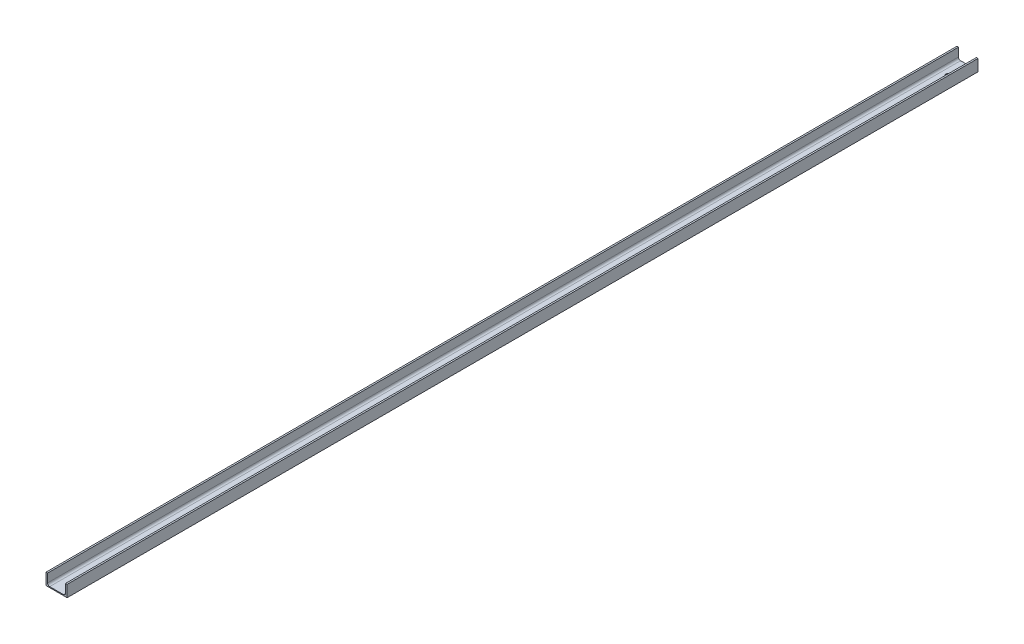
ISO-10303-21;
HEADER;
FILE_DESCRIPTION(('STEP AP214'),'2;1');
FILE_NAME('part.step','',(''),(''),'','','');
FILE_SCHEMA(('AUTOMOTIVE_DESIGN { 1 0 10303 214 1 1 1 1 }'));
ENDSEC;
DATA;
#1=APPLICATION_CONTEXT('core data for automotive mechanical design processes');
#2=APPLICATION_PROTOCOL_DEFINITION('international standard','automotive_design',2000,#1);
#3=PRODUCT_CONTEXT('',#1,'mechanical');
#4=PRODUCT('Part','Part','',(#3));
#5=PRODUCT_RELATED_PRODUCT_CATEGORY('part','',(#4));
#6=PRODUCT_DEFINITION_FORMATION('','',#4);
#7=PRODUCT_DEFINITION_CONTEXT('part definition',#1,'design');
#8=PRODUCT_DEFINITION('design','',#6,#7);
#9=PRODUCT_DEFINITION_SHAPE('','',#8);
#10=(LENGTH_UNIT() NAMED_UNIT(*) SI_UNIT(.MILLI.,.METRE.));
#11=(NAMED_UNIT(*) PLANE_ANGLE_UNIT() SI_UNIT($,.RADIAN.));
#12=(NAMED_UNIT(*) SI_UNIT($,.STERADIAN.) SOLID_ANGLE_UNIT());
#13=UNCERTAINTY_MEASURE_WITH_UNIT(LENGTH_MEASURE(1.E-05),#10,'distance_accuracy_value','');
#14=(GEOMETRIC_REPRESENTATION_CONTEXT(3) GLOBAL_UNCERTAINTY_ASSIGNED_CONTEXT((#13)) GLOBAL_UNIT_ASSIGNED_CONTEXT((#10,
#11,#12)) REPRESENTATION_CONTEXT('',''));
#15=CARTESIAN_POINT('',(0.,0.,0.));
#16=DIRECTION('',(0.,0.,1.));
#17=DIRECTION('',(1.,0.,0.));
#18=AXIS2_PLACEMENT_3D('',#15,#16,#17);
#19=CARTESIAN_POINT('',(0.,0.,4317.));
#20=DIRECTION('',(0.,1.,0.));
#21=DIRECTION('',(0.,0.,1.));
#22=AXIS2_PLACEMENT_3D('',#19,#20,#21);
#23=PLANE('',#22);
#24=CARTESIAN_POINT('',(50.000000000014,0.,4202.));
#25=DIRECTION('',(0.,1.,0.));
#26=DIRECTION('',(-1.,0.,0.));
#27=AXIS2_PLACEMENT_3D('',#24,#25,#26);
#28=CIRCLE('',#27,7.50000000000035);
#29=CARTESIAN_POINT('',(42.5000000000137,0.,4202.));
#30=VERTEX_POINT('',#29);
#31=EDGE_CURVE('E236',#30,#30,#28,.T.);
#32=ORIENTED_EDGE('',*,*,#31,.T.);
#33=EDGE_LOOP('',(#32));
#34=FACE_BOUND('',#33,.T.);
#35=CARTESIAN_POINT('',(50.0000000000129,0.,3893.));
#36=DIRECTION('',(0.,1.,0.));
#37=DIRECTION('',(-1.,0.,0.));
#38=AXIS2_PLACEMENT_3D('',#35,#36,#37);
#39=CIRCLE('',#38,7.4999999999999);
#40=CARTESIAN_POINT('',(42.500000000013,0.,3893.));
#41=VERTEX_POINT('',#40);
#42=EDGE_CURVE('E240',#41,#41,#39,.T.);
#43=ORIENTED_EDGE('',*,*,#42,.T.);
#44=EDGE_LOOP('',(#43));
#45=FACE_BOUND('',#44,.T.);
#46=CARTESIAN_POINT('',(50.0000000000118,0.,3584.));
#47=DIRECTION('',(0.,1.,0.));
#48=DIRECTION('',(-1.,0.,0.));
#49=AXIS2_PLACEMENT_3D('',#46,#47,#48);
#50=CIRCLE('',#49,7.4999999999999);
#51=CARTESIAN_POINT('',(42.5000000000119,0.,3584.));
#52=VERTEX_POINT('',#51);
#53=EDGE_CURVE('E244',#52,#52,#50,.T.);
#54=ORIENTED_EDGE('',*,*,#53,.T.);
#55=EDGE_LOOP('',(#54));
#56=FACE_BOUND('',#55,.T.);
#57=CARTESIAN_POINT('',(50.0000000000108,0.,3275.));
#58=DIRECTION('',(0.,1.,0.));
#59=DIRECTION('',(-1.,0.,0.));
#60=AXIS2_PLACEMENT_3D('',#57,#58,#59);
#61=CIRCLE('',#60,7.4999999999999);
#62=CARTESIAN_POINT('',(42.5000000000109,0.,3275.));
#63=VERTEX_POINT('',#62);
#64=EDGE_CURVE('E248',#63,#63,#61,.T.);
#65=ORIENTED_EDGE('',*,*,#64,.T.);
#66=EDGE_LOOP('',(#65));
#67=FACE_BOUND('',#66,.T.);
#68=CARTESIAN_POINT('',(50.0000000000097,0.,2966.));
#69=DIRECTION('',(0.,1.,0.));
#70=DIRECTION('',(-1.,0.,0.));
#71=AXIS2_PLACEMENT_3D('',#68,#69,#70);
#72=CIRCLE('',#71,7.4999999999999);
#73=CARTESIAN_POINT('',(42.5000000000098,0.,2966.));
#74=VERTEX_POINT('',#73);
#75=EDGE_CURVE('E252',#74,#74,#72,.T.);
#76=ORIENTED_EDGE('',*,*,#75,.T.);
#77=EDGE_LOOP('',(#76));
#78=FACE_BOUND('',#77,.T.);
#79=CARTESIAN_POINT('',(50.0000000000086,0.,2657.));
#80=DIRECTION('',(0.,1.,0.));
#81=DIRECTION('',(-1.,0.,0.));
#82=AXIS2_PLACEMENT_3D('',#79,#80,#81);
#83=CIRCLE('',#82,7.4999999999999);
#84=CARTESIAN_POINT('',(42.5000000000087,0.,2657.));
#85=VERTEX_POINT('',#84);
#86=EDGE_CURVE('E256',#85,#85,#83,.T.);
#87=ORIENTED_EDGE('',*,*,#86,.T.);
#88=EDGE_LOOP('',(#87));
#89=FACE_BOUND('',#88,.T.);
#90=CARTESIAN_POINT('',(50.0000000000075,0.,2348.));
#91=DIRECTION('',(0.,1.,0.));
#92=DIRECTION('',(-1.,0.,0.));
#93=AXIS2_PLACEMENT_3D('',#90,#91,#92);
#94=CIRCLE('',#93,7.4999999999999);
#95=CARTESIAN_POINT('',(42.5000000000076,0.,2348.));
#96=VERTEX_POINT('',#95);
#97=EDGE_CURVE('E260',#96,#96,#94,.T.);
#98=ORIENTED_EDGE('',*,*,#97,.T.);
#99=EDGE_LOOP('',(#98));
#100=FACE_BOUND('',#99,.T.);
#101=CARTESIAN_POINT('',(50.0000000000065,0.,2039.));
#102=DIRECTION('',(0.,1.,0.));
#103=DIRECTION('',(-1.,0.,0.));
#104=AXIS2_PLACEMENT_3D('',#101,#102,#103);
#105=CIRCLE('',#104,7.4999999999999);
#106=CARTESIAN_POINT('',(42.5000000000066,0.,2039.));
#107=VERTEX_POINT('',#106);
#108=EDGE_CURVE('E264',#107,#107,#105,.T.);
#109=ORIENTED_EDGE('',*,*,#108,.T.);
#110=EDGE_LOOP('',(#109));
#111=FACE_BOUND('',#110,.T.);
#112=CARTESIAN_POINT('',(50.0000000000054,0.,1730.));
#113=DIRECTION('',(0.,1.,0.));
#114=DIRECTION('',(-1.,0.,0.));
#115=AXIS2_PLACEMENT_3D('',#112,#113,#114);
#116=CIRCLE('',#115,7.4999999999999);
#117=CARTESIAN_POINT('',(42.5000000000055,0.,1730.));
#118=VERTEX_POINT('',#117);
#119=EDGE_CURVE('E268',#118,#118,#116,.T.);
#120=ORIENTED_EDGE('',*,*,#119,.T.);
#121=EDGE_LOOP('',(#120));
#122=FACE_BOUND('',#121,.T.);
#123=CARTESIAN_POINT('',(50.0000000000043,0.,1421.));
#124=DIRECTION('',(0.,1.,0.));
#125=DIRECTION('',(-1.,0.,0.));
#126=AXIS2_PLACEMENT_3D('',#123,#124,#125);
#127=CIRCLE('',#126,7.50000000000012);
#128=CARTESIAN_POINT('',(42.5000000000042,0.,1421.));
#129=VERTEX_POINT('',#128);
#130=EDGE_CURVE('E272',#129,#129,#127,.T.);
#131=ORIENTED_EDGE('',*,*,#130,.T.);
#132=EDGE_LOOP('',(#131));
#133=FACE_BOUND('',#132,.T.);
#134=CARTESIAN_POINT('',(50.0000000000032,0.,1112.));
#135=DIRECTION('',(0.,1.,0.));
#136=DIRECTION('',(-1.,0.,0.));
#137=AXIS2_PLACEMENT_3D('',#134,#135,#136);
#138=CIRCLE('',#137,7.4999999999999);
#139=CARTESIAN_POINT('',(42.5000000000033,0.,1112.));
#140=VERTEX_POINT('',#139);
#141=EDGE_CURVE('E276',#140,#140,#138,.T.);
#142=ORIENTED_EDGE('',*,*,#141,.T.);
#143=EDGE_LOOP('',(#142));
#144=FACE_BOUND('',#143,.T.);
#145=CARTESIAN_POINT('',(50.0000000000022,0.,803.));
#146=DIRECTION('',(0.,1.,0.));
#147=DIRECTION('',(-1.,0.,0.));
#148=AXIS2_PLACEMENT_3D('',#145,#146,#147);
#149=CIRCLE('',#148,7.50000000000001);
#150=CARTESIAN_POINT('',(42.5000000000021,0.,803.));
#151=VERTEX_POINT('',#150);
#152=EDGE_CURVE('E280',#151,#151,#149,.T.);
#153=ORIENTED_EDGE('',*,*,#152,.T.);
#154=EDGE_LOOP('',(#153));
#155=FACE_BOUND('',#154,.T.);
#156=CARTESIAN_POINT('',(50.0000000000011,0.,494.));
#157=DIRECTION('',(0.,1.,0.));
#158=DIRECTION('',(-1.,0.,0.));
#159=AXIS2_PLACEMENT_3D('',#156,#157,#158);
#160=CIRCLE('',#159,7.50000000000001);
#161=CARTESIAN_POINT('',(42.5000000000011,0.,494.));
#162=VERTEX_POINT('',#161);
#163=EDGE_CURVE('E284',#162,#162,#160,.T.);
#164=ORIENTED_EDGE('',*,*,#163,.T.);
#165=EDGE_LOOP('',(#164));
#166=FACE_BOUND('',#165,.T.);
#167=CARTESIAN_POINT('',(50.,0.,90.));
#168=DIRECTION('',(0.,1.,0.));
#169=DIRECTION('',(-1.,0.,0.));
#170=AXIS2_PLACEMENT_3D('',#167,#168,#169);
#171=CIRCLE('',#170,12.5);
#172=CARTESIAN_POINT('',(37.5,0.,90.));
#173=VERTEX_POINT('',#172);
#174=EDGE_CURVE('E288',#173,#173,#171,.T.);
#175=ORIENTED_EDGE('',*,*,#174,.T.);
#176=EDGE_LOOP('',(#175));
#177=FACE_BOUND('',#176,.T.);
#178=CARTESIAN_POINT('',(50.,0.,185.));
#179=DIRECTION('',(0.,1.,0.));
#180=DIRECTION('',(-1.,0.,0.));
#181=AXIS2_PLACEMENT_3D('',#178,#179,#180);
#182=CIRCLE('',#181,7.50000000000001);
#183=CARTESIAN_POINT('',(42.5,0.,185.));
#184=VERTEX_POINT('',#183);
#185=EDGE_CURVE('E126',#184,#184,#182,.T.);
#186=ORIENTED_EDGE('',*,*,#185,.T.);
#187=EDGE_LOOP('',(#186));
#188=FACE_BOUND('',#187,.T.);
#189=DIRECTION('',(1.,0.,0.));
#190=VECTOR('',#189,1.);
#191=CARTESIAN_POINT('',(0.,0.,0.));
#192=LINE('',#191,#190);
#193=CARTESIAN_POINT('',(0.,0.,0.));
#194=VERTEX_POINT('',#193);
#195=CARTESIAN_POINT('',(100.,0.,0.));
#196=VERTEX_POINT('',#195);
#197=EDGE_CURVE('E114',#194,#196,#192,.T.);
#198=ORIENTED_EDGE('',*,*,#197,.T.);
#199=DIRECTION('',(0.,0.,-1.));
#200=VECTOR('',#199,1.);
#201=CARTESIAN_POINT('',(100.,0.,4317.));
#202=LINE('',#201,#200);
#203=CARTESIAN_POINT('',(100.,0.,4317.));
#204=VERTEX_POINT('',#203);
#205=EDGE_CURVE('E11',#204,#196,#202,.T.);
#206=ORIENTED_EDGE('',*,*,#205,.F.);
#207=DIRECTION('',(1.,0.,0.));
#208=VECTOR('',#207,1.);
#209=CARTESIAN_POINT('',(0.,0.,4317.));
#210=LINE('',#209,#208);
#211=CARTESIAN_POINT('',(0.,0.,4317.));
#212=VERTEX_POINT('',#211);
#213=EDGE_CURVE('E150',#212,#204,#210,.T.);
#214=ORIENTED_EDGE('',*,*,#213,.F.);
#215=DIRECTION('',(0.,0.,-1.));
#216=VECTOR('',#215,1.);
#217=CARTESIAN_POINT('',(0.,0.,4317.));
#218=LINE('',#217,#216);
#219=EDGE_CURVE('E46',#212,#194,#218,.T.);
#220=ORIENTED_EDGE('',*,*,#219,.T.);
#221=EDGE_LOOP('',(#198,#206,#214,#220));
#222=FACE_BOUND('',#221,.T.);
#223=ADVANCED_FACE('F32',(#34,#45,#56,#67,#78,#89,#100,#111,#122,#133,#144,#155,#166,#177,#188,
#222),#23,.F.);
#224=CARTESIAN_POINT('',(100.,0.,4317.));
#225=DIRECTION('',(-1.,0.,0.));
#226=DIRECTION('',(0.,0.,1.));
#227=AXIS2_PLACEMENT_3D('',#224,#225,#226);
#228=PLANE('',#227);
#229=DIRECTION('',(0.,1.,0.));
#230=VECTOR('',#229,1.);
#231=CARTESIAN_POINT('',(100.,0.,0.));
#232=LINE('',#231,#230);
#233=CARTESIAN_POINT('',(100.,55.,0.));
#234=VERTEX_POINT('',#233);
#235=EDGE_CURVE('E110',#196,#234,#232,.T.);
#236=ORIENTED_EDGE('',*,*,#235,.T.);
#237=DIRECTION('',(0.,0.,-1.));
#238=VECTOR('',#237,1.);
#239=CARTESIAN_POINT('',(100.,55.,4317.));
#240=LINE('',#239,#238);
#241=CARTESIAN_POINT('',(100.,55.,4317.));
#242=VERTEX_POINT('',#241);
#243=EDGE_CURVE('E39',#242,#234,#240,.T.);
#244=ORIENTED_EDGE('',*,*,#243,.F.);
#245=DIRECTION('',(0.,1.,0.));
#246=VECTOR('',#245,1.);
#247=CARTESIAN_POINT('',(100.,0.,4317.));
#248=LINE('',#247,#246);
#249=EDGE_CURVE('E123',#204,#242,#248,.T.);
#250=ORIENTED_EDGE('',*,*,#249,.F.);
#251=ORIENTED_EDGE('',*,*,#205,.T.);
#252=EDGE_LOOP('',(#236,#244,#250,#251));
#253=FACE_BOUND('',#252,.T.);
#254=ADVANCED_FACE('F122',(#253),#228,.F.);
#255=CARTESIAN_POINT('',(100.,55.,4317.));
#256=DIRECTION('',(0.,-1.,0.));
#257=DIRECTION('',(0.,0.,-1.));
#258=AXIS2_PLACEMENT_3D('',#255,#256,#257);
#259=PLANE('',#258);
#260=DIRECTION('',(-1.,0.,0.));
#261=VECTOR('',#260,1.);
#262=CARTESIAN_POINT('',(100.,55.,0.));
#263=LINE('',#262,#261);
#264=CARTESIAN_POINT('',(92.5,55.,0.));
#265=VERTEX_POINT('',#264);
#266=EDGE_CURVE('E116',#234,#265,#263,.T.);
#267=ORIENTED_EDGE('',*,*,#266,.T.);
#268=DIRECTION('',(0.,0.,-1.));
#269=VECTOR('',#268,1.);
#270=CARTESIAN_POINT('',(92.5,55.,4317.));
#271=LINE('',#270,#269);
#272=CARTESIAN_POINT('',(92.5,55.,4317.));
#273=VERTEX_POINT('',#272);
#274=EDGE_CURVE('E185',#273,#265,#271,.T.);
#275=ORIENTED_EDGE('',*,*,#274,.F.);
#276=DIRECTION('',(-1.,0.,0.));
#277=VECTOR('',#276,1.);
#278=CARTESIAN_POINT('',(100.,55.,4317.));
#279=LINE('',#278,#277);
#280=EDGE_CURVE('E153',#242,#273,#279,.T.);
#281=ORIENTED_EDGE('',*,*,#280,.F.);
#282=ORIENTED_EDGE('',*,*,#243,.T.);
#283=EDGE_LOOP('',(#267,#275,#281,#282));
#284=FACE_BOUND('',#283,.T.);
#285=ADVANCED_FACE('F189',(#284),#259,.F.);
#286=CARTESIAN_POINT('',(92.5,55.,4317.));
#287=DIRECTION('',(1.,0.,0.));
#288=DIRECTION('',(0.,0.,-1.));
#289=AXIS2_PLACEMENT_3D('',#286,#287,#288);
#290=PLANE('',#289);
#291=DIRECTION('',(0.,-1.,0.));
#292=VECTOR('',#291,1.);
#293=CARTESIAN_POINT('',(92.5,55.,0.));
#294=LINE('',#293,#292);
#295=CARTESIAN_POINT('',(92.5,14.5000000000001,0.));
#296=VERTEX_POINT('',#295);
#297=EDGE_CURVE('E134',#265,#296,#294,.T.);
#298=ORIENTED_EDGE('',*,*,#297,.T.);
#299=DIRECTION('',(0.,0.,-1.));
#300=VECTOR('',#299,1.);
#301=CARTESIAN_POINT('',(92.5,14.5000000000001,4317.));
#302=LINE('',#301,#300);
#303=CARTESIAN_POINT('',(92.5,14.5000000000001,4317.));
#304=VERTEX_POINT('',#303);
#305=EDGE_CURVE('E182',#304,#296,#302,.T.);
#306=ORIENTED_EDGE('',*,*,#305,.F.);
#307=DIRECTION('',(0.,-1.,0.));
#308=VECTOR('',#307,1.);
#309=CARTESIAN_POINT('',(92.5,55.,4317.));
#310=LINE('',#309,#308);
#311=EDGE_CURVE('E155',#273,#304,#310,.T.);
#312=ORIENTED_EDGE('',*,*,#311,.F.);
#313=ORIENTED_EDGE('',*,*,#274,.T.);
#314=EDGE_LOOP('',(#298,#306,#312,#313));
#315=FACE_BOUND('',#314,.T.);
#316=ADVANCED_FACE('F219',(#315),#290,.F.);
#317=CARTESIAN_POINT('',(82.5,14.5,4317.));
#318=DIRECTION('',(0.,0.,-1.));
#319=DIRECTION('',(-1.,0.,0.));
#320=AXIS2_PLACEMENT_3D('',#317,#318,#319);
#321=CYLINDRICAL_SURFACE('',#320,10.);
#322=CARTESIAN_POINT('',(82.5,14.5,0.));
#323=DIRECTION('',(0.,0.,-1.));
#324=DIRECTION('',(-1.,0.,0.));
#325=AXIS2_PLACEMENT_3D('',#322,#323,#324);
#326=CIRCLE('',#325,10.);
#327=CARTESIAN_POINT('',(82.4999999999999,4.5,0.));
#328=VERTEX_POINT('',#327);
#329=EDGE_CURVE('E136',#296,#328,#326,.T.);
#330=ORIENTED_EDGE('',*,*,#329,.T.);
#331=DIRECTION('',(0.,0.,-1.));
#332=VECTOR('',#331,1.);
#333=CARTESIAN_POINT('',(82.4999999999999,4.5,4317.));
#334=LINE('',#333,#332);
#335=CARTESIAN_POINT('',(82.4999999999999,4.5,4317.));
#336=VERTEX_POINT('',#335);
#337=EDGE_CURVE('E179',#336,#328,#334,.T.);
#338=ORIENTED_EDGE('',*,*,#337,.F.);
#339=CARTESIAN_POINT('',(82.5,14.5,4317.));
#340=DIRECTION('',(0.,0.,-1.));
#341=DIRECTION('',(-1.,0.,0.));
#342=AXIS2_PLACEMENT_3D('',#339,#340,#341);
#343=CIRCLE('',#342,10.);
#344=EDGE_CURVE('E157',#304,#336,#343,.T.);
#345=ORIENTED_EDGE('',*,*,#344,.F.);
#346=ORIENTED_EDGE('',*,*,#305,.T.);
#347=EDGE_LOOP('',(#330,#338,#345,#346));
#348=FACE_BOUND('',#347,.T.);
#349=ADVANCED_FACE('F216',(#348),#321,.F.);
#350=CARTESIAN_POINT('',(82.4999999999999,4.5,4317.));
#351=DIRECTION('',(0.,-1.,0.));
#352=DIRECTION('',(1.,0.,0.));
#353=AXIS2_PLACEMENT_3D('',#350,#351,#352);
#354=PLANE('',#353);
#355=CARTESIAN_POINT('',(50.000000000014,4.49999999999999,4202.));
#356=DIRECTION('',(0.,1.,0.));
#357=DIRECTION('',(-1.,0.,0.));
#358=AXIS2_PLACEMENT_3D('',#355,#356,#357);
#359=CIRCLE('',#358,7.50000000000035);
#360=CARTESIAN_POINT('',(42.5000000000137,4.49999999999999,4202.));
#361=VERTEX_POINT('',#360);
#362=EDGE_CURVE('E353',#361,#361,#359,.T.);
#363=ORIENTED_EDGE('',*,*,#362,.F.);
#364=EDGE_LOOP('',(#363));
#365=FACE_BOUND('',#364,.T.);
#366=CARTESIAN_POINT('',(50.0000000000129,4.49999999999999,3893.));
#367=DIRECTION('',(0.,1.,0.));
#368=DIRECTION('',(-1.,0.,0.));
#369=AXIS2_PLACEMENT_3D('',#366,#367,#368);
#370=CIRCLE('',#369,7.4999999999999);
#371=CARTESIAN_POINT('',(42.500000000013,4.49999999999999,3893.));
#372=VERTEX_POINT('',#371);
#373=EDGE_CURVE('E349',#372,#372,#370,.T.);
#374=ORIENTED_EDGE('',*,*,#373,.F.);
#375=EDGE_LOOP('',(#374));
#376=FACE_BOUND('',#375,.T.);
#377=CARTESIAN_POINT('',(50.0000000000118,4.49999999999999,3584.));
#378=DIRECTION('',(0.,1.,0.));
#379=DIRECTION('',(-1.,0.,0.));
#380=AXIS2_PLACEMENT_3D('',#377,#378,#379);
#381=CIRCLE('',#380,7.4999999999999);
#382=CARTESIAN_POINT('',(42.5000000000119,4.49999999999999,3584.));
#383=VERTEX_POINT('',#382);
#384=EDGE_CURVE('E345',#383,#383,#381,.T.);
#385=ORIENTED_EDGE('',*,*,#384,.F.);
#386=EDGE_LOOP('',(#385));
#387=FACE_BOUND('',#386,.T.);
#388=CARTESIAN_POINT('',(50.0000000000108,4.49999999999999,3275.));
#389=DIRECTION('',(0.,1.,0.));
#390=DIRECTION('',(-1.,0.,0.));
#391=AXIS2_PLACEMENT_3D('',#388,#389,#390);
#392=CIRCLE('',#391,7.4999999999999);
#393=CARTESIAN_POINT('',(42.5000000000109,4.49999999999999,3275.));
#394=VERTEX_POINT('',#393);
#395=EDGE_CURVE('E341',#394,#394,#392,.T.);
#396=ORIENTED_EDGE('',*,*,#395,.F.);
#397=EDGE_LOOP('',(#396));
#398=FACE_BOUND('',#397,.T.);
#399=CARTESIAN_POINT('',(50.0000000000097,4.49999999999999,2966.));
#400=DIRECTION('',(0.,1.,0.));
#401=DIRECTION('',(-1.,0.,0.));
#402=AXIS2_PLACEMENT_3D('',#399,#400,#401);
#403=CIRCLE('',#402,7.4999999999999);
#404=CARTESIAN_POINT('',(42.5000000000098,4.49999999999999,2966.));
#405=VERTEX_POINT('',#404);
#406=EDGE_CURVE('E337',#405,#405,#403,.T.);
#407=ORIENTED_EDGE('',*,*,#406,.F.);
#408=EDGE_LOOP('',(#407));
#409=FACE_BOUND('',#408,.T.);
#410=CARTESIAN_POINT('',(50.0000000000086,4.49999999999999,2657.));
#411=DIRECTION('',(0.,1.,0.));
#412=DIRECTION('',(-1.,0.,0.));
#413=AXIS2_PLACEMENT_3D('',#410,#411,#412);
#414=CIRCLE('',#413,7.4999999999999);
#415=CARTESIAN_POINT('',(42.5000000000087,4.49999999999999,2657.));
#416=VERTEX_POINT('',#415);
#417=EDGE_CURVE('E333',#416,#416,#414,.T.);
#418=ORIENTED_EDGE('',*,*,#417,.F.);
#419=EDGE_LOOP('',(#418));
#420=FACE_BOUND('',#419,.T.);
#421=CARTESIAN_POINT('',(50.0000000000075,4.49999999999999,2348.));
#422=DIRECTION('',(0.,1.,0.));
#423=DIRECTION('',(-1.,0.,0.));
#424=AXIS2_PLACEMENT_3D('',#421,#422,#423);
#425=CIRCLE('',#424,7.4999999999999);
#426=CARTESIAN_POINT('',(42.5000000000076,4.49999999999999,2348.));
#427=VERTEX_POINT('',#426);
#428=EDGE_CURVE('E329',#427,#427,#425,.T.);
#429=ORIENTED_EDGE('',*,*,#428,.F.);
#430=EDGE_LOOP('',(#429));
#431=FACE_BOUND('',#430,.T.);
#432=CARTESIAN_POINT('',(50.0000000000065,4.49999999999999,2039.));
#433=DIRECTION('',(0.,1.,0.));
#434=DIRECTION('',(-1.,0.,0.));
#435=AXIS2_PLACEMENT_3D('',#432,#433,#434);
#436=CIRCLE('',#435,7.4999999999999);
#437=CARTESIAN_POINT('',(42.5000000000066,4.49999999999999,2039.));
#438=VERTEX_POINT('',#437);
#439=EDGE_CURVE('E325',#438,#438,#436,.T.);
#440=ORIENTED_EDGE('',*,*,#439,.F.);
#441=EDGE_LOOP('',(#440));
#442=FACE_BOUND('',#441,.T.);
#443=CARTESIAN_POINT('',(50.0000000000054,4.49999999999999,1730.));
#444=DIRECTION('',(0.,1.,0.));
#445=DIRECTION('',(-1.,0.,0.));
#446=AXIS2_PLACEMENT_3D('',#443,#444,#445);
#447=CIRCLE('',#446,7.4999999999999);
#448=CARTESIAN_POINT('',(42.5000000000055,4.49999999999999,1730.));
#449=VERTEX_POINT('',#448);
#450=EDGE_CURVE('E321',#449,#449,#447,.T.);
#451=ORIENTED_EDGE('',*,*,#450,.F.);
#452=EDGE_LOOP('',(#451));
#453=FACE_BOUND('',#452,.T.);
#454=CARTESIAN_POINT('',(50.0000000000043,4.49999999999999,1421.));
#455=DIRECTION('',(0.,1.,0.));
#456=DIRECTION('',(-1.,0.,0.));
#457=AXIS2_PLACEMENT_3D('',#454,#455,#456);
#458=CIRCLE('',#457,7.50000000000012);
#459=CARTESIAN_POINT('',(42.5000000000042,4.49999999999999,1421.));
#460=VERTEX_POINT('',#459);
#461=EDGE_CURVE('E317',#460,#460,#458,.T.);
#462=ORIENTED_EDGE('',*,*,#461,.F.);
#463=EDGE_LOOP('',(#462));
#464=FACE_BOUND('',#463,.T.);
#465=CARTESIAN_POINT('',(50.0000000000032,4.49999999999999,1112.));
#466=DIRECTION('',(0.,1.,0.));
#467=DIRECTION('',(-1.,0.,0.));
#468=AXIS2_PLACEMENT_3D('',#465,#466,#467);
#469=CIRCLE('',#468,7.4999999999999);
#470=CARTESIAN_POINT('',(42.5000000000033,4.49999999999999,1112.));
#471=VERTEX_POINT('',#470);
#472=EDGE_CURVE('E313',#471,#471,#469,.T.);
#473=ORIENTED_EDGE('',*,*,#472,.F.);
#474=EDGE_LOOP('',(#473));
#475=FACE_BOUND('',#474,.T.);
#476=CARTESIAN_POINT('',(50.0000000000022,4.49999999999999,803.));
#477=DIRECTION('',(0.,1.,0.));
#478=DIRECTION('',(-1.,0.,0.));
#479=AXIS2_PLACEMENT_3D('',#476,#477,#478);
#480=CIRCLE('',#479,7.50000000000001);
#481=CARTESIAN_POINT('',(42.5000000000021,4.49999999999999,803.));
#482=VERTEX_POINT('',#481);
#483=EDGE_CURVE('E309',#482,#482,#480,.T.);
#484=ORIENTED_EDGE('',*,*,#483,.F.);
#485=EDGE_LOOP('',(#484));
#486=FACE_BOUND('',#485,.T.);
#487=CARTESIAN_POINT('',(50.0000000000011,4.49999999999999,494.));
#488=DIRECTION('',(0.,1.,0.));
#489=DIRECTION('',(-1.,0.,0.));
#490=AXIS2_PLACEMENT_3D('',#487,#488,#489);
#491=CIRCLE('',#490,7.50000000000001);
#492=CARTESIAN_POINT('',(42.5000000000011,4.49999999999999,494.));
#493=VERTEX_POINT('',#492);
#494=EDGE_CURVE('E305',#493,#493,#491,.T.);
#495=ORIENTED_EDGE('',*,*,#494,.F.);
#496=EDGE_LOOP('',(#495));
#497=FACE_BOUND('',#496,.T.);
#498=CARTESIAN_POINT('',(50.,4.49999999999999,90.));
#499=DIRECTION('',(0.,1.,0.));
#500=DIRECTION('',(-1.,0.,0.));
#501=AXIS2_PLACEMENT_3D('',#498,#499,#500);
#502=CIRCLE('',#501,12.5);
#503=CARTESIAN_POINT('',(37.5,4.49999999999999,90.));
#504=VERTEX_POINT('',#503);
#505=EDGE_CURVE('E299',#504,#504,#502,.T.);
#506=ORIENTED_EDGE('',*,*,#505,.F.);
#507=EDGE_LOOP('',(#506));
#508=FACE_BOUND('',#507,.T.);
#509=CARTESIAN_POINT('',(50.,4.49999999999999,185.));
#510=DIRECTION('',(0.,1.,0.));
#511=DIRECTION('',(-1.,0.,0.));
#512=AXIS2_PLACEMENT_3D('',#509,#510,#511);
#513=CIRCLE('',#512,7.50000000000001);
#514=CARTESIAN_POINT('',(42.5,4.49999999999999,185.));
#515=VERTEX_POINT('',#514);
#516=EDGE_CURVE('E129',#515,#515,#513,.T.);
#517=ORIENTED_EDGE('',*,*,#516,.F.);
#518=EDGE_LOOP('',(#517));
#519=FACE_BOUND('',#518,.T.);
#520=DIRECTION('',(-1.,0.,0.));
#521=VECTOR('',#520,1.);
#522=CARTESIAN_POINT('',(82.4999999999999,4.5,0.));
#523=LINE('',#522,#521);
#524=CARTESIAN_POINT('',(17.5000000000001,4.49999999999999,0.));
#525=VERTEX_POINT('',#524);
#526=EDGE_CURVE('E138',#328,#525,#523,.T.);
#527=ORIENTED_EDGE('',*,*,#526,.T.);
#528=DIRECTION('',(0.,0.,-1.));
#529=VECTOR('',#528,1.);
#530=CARTESIAN_POINT('',(17.5000000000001,4.49999999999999,4317.));
#531=LINE('',#530,#529);
#532=CARTESIAN_POINT('',(17.5000000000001,4.49999999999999,4317.));
#533=VERTEX_POINT('',#532);
#534=EDGE_CURVE('E176',#533,#525,#531,.T.);
#535=ORIENTED_EDGE('',*,*,#534,.F.);
#536=DIRECTION('',(-1.,0.,0.));
#537=VECTOR('',#536,1.);
#538=CARTESIAN_POINT('',(82.4999999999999,4.5,4317.));
#539=LINE('',#538,#537);
#540=EDGE_CURVE('E159',#336,#533,#539,.T.);
#541=ORIENTED_EDGE('',*,*,#540,.F.);
#542=ORIENTED_EDGE('',*,*,#337,.T.);
#543=EDGE_LOOP('',(#527,#535,#541,#542));
#544=FACE_BOUND('',#543,.T.);
#545=ADVANCED_FACE('F212',(#365,#376,#387,#398,#409,#420,#431,#442,#453,#464,#475,#486,#497,
#508,#519,#544),#354,.F.);
#546=CARTESIAN_POINT('',(17.5,14.5,4317.));
#547=DIRECTION('',(0.,0.,-1.));
#548=DIRECTION('',(-1.,0.,0.));
#549=AXIS2_PLACEMENT_3D('',#546,#547,#548);
#550=CYLINDRICAL_SURFACE('',#549,10.);
#551=CARTESIAN_POINT('',(17.5,14.5,0.));
#552=DIRECTION('',(0.,0.,-1.));
#553=DIRECTION('',(-1.,0.,0.));
#554=AXIS2_PLACEMENT_3D('',#551,#552,#553);
#555=CIRCLE('',#554,10.);
#556=CARTESIAN_POINT('',(7.50000000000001,14.5000000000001,0.));
#557=VERTEX_POINT('',#556);
#558=EDGE_CURVE('E140',#525,#557,#555,.T.);
#559=ORIENTED_EDGE('',*,*,#558,.T.);
#560=DIRECTION('',(0.,0.,-1.));
#561=VECTOR('',#560,1.);
#562=CARTESIAN_POINT('',(7.50000000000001,14.5000000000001,4317.));
#563=LINE('',#562,#561);
#564=CARTESIAN_POINT('',(7.50000000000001,14.5000000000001,4317.));
#565=VERTEX_POINT('',#564);
#566=EDGE_CURVE('E173',#565,#557,#563,.T.);
#567=ORIENTED_EDGE('',*,*,#566,.F.);
#568=CARTESIAN_POINT('',(17.5,14.5,4317.));
#569=DIRECTION('',(0.,0.,-1.));
#570=DIRECTION('',(-1.,0.,0.));
#571=AXIS2_PLACEMENT_3D('',#568,#569,#570);
#572=CIRCLE('',#571,10.);
#573=EDGE_CURVE('E161',#533,#565,#572,.T.);
#574=ORIENTED_EDGE('',*,*,#573,.F.);
#575=ORIENTED_EDGE('',*,*,#534,.T.);
#576=EDGE_LOOP('',(#559,#567,#574,#575));
#577=FACE_BOUND('',#576,.T.);
#578=ADVANCED_FACE('F208',(#577),#550,.F.);
#579=CARTESIAN_POINT('',(7.50000000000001,14.5000000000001,4317.));
#580=DIRECTION('',(-1.,0.,0.));
#581=DIRECTION('',(0.,-1.,0.));
#582=AXIS2_PLACEMENT_3D('',#579,#580,#581);
#583=PLANE('',#582);
#584=DIRECTION('',(0.,1.,0.));
#585=VECTOR('',#584,1.);
#586=CARTESIAN_POINT('',(7.50000000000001,14.5000000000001,0.));
#587=LINE('',#586,#585);
#588=CARTESIAN_POINT('',(7.5,55.,0.));
#589=VERTEX_POINT('',#588);
#590=EDGE_CURVE('E142',#557,#589,#587,.T.);
#591=ORIENTED_EDGE('',*,*,#590,.T.);
#592=DIRECTION('',(0.,0.,-1.));
#593=VECTOR('',#592,1.);
#594=CARTESIAN_POINT('',(7.5,55.,4317.));
#595=LINE('',#594,#593);
#596=CARTESIAN_POINT('',(7.5,55.,4317.));
#597=VERTEX_POINT('',#596);
#598=EDGE_CURVE('E171',#597,#589,#595,.T.);
#599=ORIENTED_EDGE('',*,*,#598,.F.);
#600=DIRECTION('',(0.,1.,0.));
#601=VECTOR('',#600,1.);
#602=CARTESIAN_POINT('',(7.50000000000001,14.5000000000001,4317.));
#603=LINE('',#602,#601);
#604=EDGE_CURVE('E163',#565,#597,#603,.T.);
#605=ORIENTED_EDGE('',*,*,#604,.F.);
#606=ORIENTED_EDGE('',*,*,#566,.T.);
#607=EDGE_LOOP('',(#591,#599,#605,#606));
#608=FACE_BOUND('',#607,.T.);
#609=ADVANCED_FACE('F203',(#608),#583,.F.);
#610=CARTESIAN_POINT('',(0.,55.,4317.));
#611=DIRECTION('',(0.,1.,0.));
#612=DIRECTION('',(0.,0.,1.));
#613=AXIS2_PLACEMENT_3D('',#610,#611,#612);
#614=PLANE('',#613);
#615=DIRECTION('',(1.,0.,0.));
#616=VECTOR('',#615,1.);
#617=CARTESIAN_POINT('',(0.,55.,0.));
#618=LINE('',#617,#616);
#619=CARTESIAN_POINT('',(0.,55.,0.));
#620=VERTEX_POINT('',#619);
#621=EDGE_CURVE('E145',#620,#589,#618,.T.);
#622=ORIENTED_EDGE('',*,*,#621,.F.);
#623=DIRECTION('',(0.,0.,-1.));
#624=VECTOR('',#623,1.);
#625=CARTESIAN_POINT('',(0.,55.,4317.));
#626=LINE('',#625,#624);
#627=CARTESIAN_POINT('',(0.,55.,4317.));
#628=VERTEX_POINT('',#627);
#629=EDGE_CURVE('E54',#628,#620,#626,.T.);
#630=ORIENTED_EDGE('',*,*,#629,.F.);
#631=DIRECTION('',(1.,0.,0.));
#632=VECTOR('',#631,1.);
#633=CARTESIAN_POINT('',(0.,55.,4317.));
#634=LINE('',#633,#632);
#635=EDGE_CURVE('E165',#628,#597,#634,.T.);
#636=ORIENTED_EDGE('',*,*,#635,.T.);
#637=ORIENTED_EDGE('',*,*,#598,.T.);
#638=EDGE_LOOP('',(#622,#630,#636,#637));
#639=FACE_BOUND('',#638,.T.);
#640=ADVANCED_FACE('F197',(#639),#614,.T.);
#641=CARTESIAN_POINT('',(0.,0.,4317.));
#642=DIRECTION('',(-1.,0.,0.));
#643=DIRECTION('',(0.,0.,1.));
#644=AXIS2_PLACEMENT_3D('',#641,#642,#643);
#645=PLANE('',#644);
#646=DIRECTION('',(0.,1.,0.));
#647=VECTOR('',#646,1.);
#648=CARTESIAN_POINT('',(0.,0.,0.));
#649=LINE('',#648,#647);
#650=EDGE_CURVE('E148',#194,#620,#649,.T.);
#651=ORIENTED_EDGE('',*,*,#650,.F.);
#652=ORIENTED_EDGE('',*,*,#219,.F.);
#653=DIRECTION('',(0.,1.,0.));
#654=VECTOR('',#653,1.);
#655=CARTESIAN_POINT('',(0.,0.,4317.));
#656=LINE('',#655,#654);
#657=EDGE_CURVE('E167',#212,#628,#656,.T.);
#658=ORIENTED_EDGE('',*,*,#657,.T.);
#659=ORIENTED_EDGE('',*,*,#629,.T.);
#660=EDGE_LOOP('',(#651,#652,#658,#659));
#661=FACE_BOUND('',#660,.T.);
#662=ADVANCED_FACE('F196',(#661),#645,.T.);
#663=CARTESIAN_POINT('',(82.5,14.5,4317.));
#664=DIRECTION('',(0.,0.,-1.));
#665=DIRECTION('',(-1.,0.,0.));
#666=AXIS2_PLACEMENT_3D('',#663,#664,#665);
#667=PLANE('',#666);
#668=ORIENTED_EDGE('',*,*,#213,.T.);
#669=ORIENTED_EDGE('',*,*,#249,.T.);
#670=ORIENTED_EDGE('',*,*,#280,.T.);
#671=ORIENTED_EDGE('',*,*,#311,.T.);
#672=ORIENTED_EDGE('',*,*,#344,.T.);
#673=ORIENTED_EDGE('',*,*,#540,.T.);
#674=ORIENTED_EDGE('',*,*,#573,.T.);
#675=ORIENTED_EDGE('',*,*,#604,.T.);
#676=ORIENTED_EDGE('',*,*,#635,.F.);
#677=ORIENTED_EDGE('',*,*,#657,.F.);
#678=EDGE_LOOP('',(#668,#669,#670,#671,#672,#673,#674,#675,#676,#677));
#679=FACE_BOUND('',#678,.T.);
#680=ADVANCED_FACE('F193',(#679),#667,.F.);
#681=CARTESIAN_POINT('',(82.5,14.5,0.));
#682=DIRECTION('',(0.,0.,-1.));
#683=DIRECTION('',(-1.,0.,0.));
#684=AXIS2_PLACEMENT_3D('',#681,#682,#683);
#685=PLANE('',#684);
#686=ORIENTED_EDGE('',*,*,#197,.F.);
#687=ORIENTED_EDGE('',*,*,#650,.T.);
#688=ORIENTED_EDGE('',*,*,#621,.T.);
#689=ORIENTED_EDGE('',*,*,#590,.F.);
#690=ORIENTED_EDGE('',*,*,#558,.F.);
#691=ORIENTED_EDGE('',*,*,#526,.F.);
#692=ORIENTED_EDGE('',*,*,#329,.F.);
#693=ORIENTED_EDGE('',*,*,#297,.F.);
#694=ORIENTED_EDGE('',*,*,#266,.F.);
#695=ORIENTED_EDGE('',*,*,#235,.F.);
#696=EDGE_LOOP('',(#686,#687,#688,#689,#690,#691,#692,#693,#694,#695));
#697=FACE_BOUND('',#696,.T.);
#698=ADVANCED_FACE('F111',(#697),#685,.T.);
#699=CARTESIAN_POINT('',(50.,0.,185.));
#700=DIRECTION('',(0.,1.,0.));
#701=DIRECTION('',(-1.,0.,0.));
#702=AXIS2_PLACEMENT_3D('',#699,#700,#701);
#703=CYLINDRICAL_SURFACE('',#702,7.50000000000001);
#704=ORIENTED_EDGE('',*,*,#185,.F.);
#705=EDGE_LOOP('',(#704));
#706=FACE_BOUND('',#705,.T.);
#707=ORIENTED_EDGE('',*,*,#516,.T.);
#708=EDGE_LOOP('',(#707));
#709=FACE_BOUND('',#708,.T.);
#710=ADVANCED_FACE('F291',(#706,#709),#703,.F.);
#711=CARTESIAN_POINT('',(50.,0.,90.));
#712=DIRECTION('',(0.,1.,0.));
#713=DIRECTION('',(-1.,0.,0.));
#714=AXIS2_PLACEMENT_3D('',#711,#712,#713);
#715=CYLINDRICAL_SURFACE('',#714,12.5);
#716=ORIENTED_EDGE('',*,*,#174,.F.);
#717=EDGE_LOOP('',(#716));
#718=FACE_BOUND('',#717,.T.);
#719=ORIENTED_EDGE('',*,*,#505,.T.);
#720=EDGE_LOOP('',(#719));
#721=FACE_BOUND('',#720,.T.);
#722=ADVANCED_FACE('F294',(#718,#721),#715,.F.);
#723=CARTESIAN_POINT('',(50.0000000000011,0.,494.));
#724=DIRECTION('',(0.,1.,0.));
#725=DIRECTION('',(-1.,0.,0.));
#726=AXIS2_PLACEMENT_3D('',#723,#724,#725);
#727=CYLINDRICAL_SURFACE('',#726,7.50000000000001);
#728=ORIENTED_EDGE('',*,*,#163,.F.);
#729=EDGE_LOOP('',(#728));
#730=FACE_BOUND('',#729,.T.);
#731=ORIENTED_EDGE('',*,*,#494,.T.);
#732=EDGE_LOOP('',(#731));
#733=FACE_BOUND('',#732,.T.);
#734=ADVANCED_FACE('F389',(#730,#733),#727,.F.);
#735=CARTESIAN_POINT('',(50.0000000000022,0.,803.));
#736=DIRECTION('',(0.,1.,0.));
#737=DIRECTION('',(-1.,0.,0.));
#738=AXIS2_PLACEMENT_3D('',#735,#736,#737);
#739=CYLINDRICAL_SURFACE('',#738,7.50000000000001);
#740=ORIENTED_EDGE('',*,*,#152,.F.);
#741=EDGE_LOOP('',(#740));
#742=FACE_BOUND('',#741,.T.);
#743=ORIENTED_EDGE('',*,*,#483,.T.);
#744=EDGE_LOOP('',(#743));
#745=FACE_BOUND('',#744,.T.);
#746=ADVANCED_FACE('F395',(#742,#745),#739,.F.);
#747=CARTESIAN_POINT('',(50.0000000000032,0.,1112.));
#748=DIRECTION('',(0.,1.,0.));
#749=DIRECTION('',(-1.,0.,0.));
#750=AXIS2_PLACEMENT_3D('',#747,#748,#749);
#751=CYLINDRICAL_SURFACE('',#750,7.4999999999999);
#752=ORIENTED_EDGE('',*,*,#141,.F.);
#753=EDGE_LOOP('',(#752));
#754=FACE_BOUND('',#753,.T.);
#755=ORIENTED_EDGE('',*,*,#472,.T.);
#756=EDGE_LOOP('',(#755));
#757=FACE_BOUND('',#756,.T.);
#758=ADVANCED_FACE('F461',(#754,#757),#751,.F.);
#759=CARTESIAN_POINT('',(50.0000000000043,0.,1421.));
#760=DIRECTION('',(0.,1.,0.));
#761=DIRECTION('',(-1.,0.,0.));
#762=AXIS2_PLACEMENT_3D('',#759,#760,#761);
#763=CYLINDRICAL_SURFACE('',#762,7.50000000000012);
#764=ORIENTED_EDGE('',*,*,#130,.F.);
#765=EDGE_LOOP('',(#764));
#766=FACE_BOUND('',#765,.T.);
#767=ORIENTED_EDGE('',*,*,#461,.T.);
#768=EDGE_LOOP('',(#767));
#769=FACE_BOUND('',#768,.T.);
#770=ADVANCED_FACE('F470',(#766,#769),#763,.F.);
#771=CARTESIAN_POINT('',(50.0000000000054,0.,1730.));
#772=DIRECTION('',(0.,1.,0.));
#773=DIRECTION('',(-1.,0.,0.));
#774=AXIS2_PLACEMENT_3D('',#771,#772,#773);
#775=CYLINDRICAL_SURFACE('',#774,7.4999999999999);
#776=ORIENTED_EDGE('',*,*,#119,.F.);
#777=EDGE_LOOP('',(#776));
#778=FACE_BOUND('',#777,.T.);
#779=ORIENTED_EDGE('',*,*,#450,.T.);
#780=EDGE_LOOP('',(#779));
#781=FACE_BOUND('',#780,.T.);
#782=ADVANCED_FACE('F480',(#778,#781),#775,.F.);
#783=CARTESIAN_POINT('',(50.0000000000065,0.,2039.));
#784=DIRECTION('',(0.,1.,0.));
#785=DIRECTION('',(-1.,0.,0.));
#786=AXIS2_PLACEMENT_3D('',#783,#784,#785);
#787=CYLINDRICAL_SURFACE('',#786,7.4999999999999);
#788=ORIENTED_EDGE('',*,*,#108,.F.);
#789=EDGE_LOOP('',(#788));
#790=FACE_BOUND('',#789,.T.);
#791=ORIENTED_EDGE('',*,*,#439,.T.);
#792=EDGE_LOOP('',(#791));
#793=FACE_BOUND('',#792,.T.);
#794=ADVANCED_FACE('F490',(#790,#793),#787,.F.);
#795=CARTESIAN_POINT('',(50.0000000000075,0.,2348.));
#796=DIRECTION('',(0.,1.,0.));
#797=DIRECTION('',(-1.,0.,0.));
#798=AXIS2_PLACEMENT_3D('',#795,#796,#797);
#799=CYLINDRICAL_SURFACE('',#798,7.4999999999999);
#800=ORIENTED_EDGE('',*,*,#97,.F.);
#801=EDGE_LOOP('',(#800));
#802=FACE_BOUND('',#801,.T.);
#803=ORIENTED_EDGE('',*,*,#428,.T.);
#804=EDGE_LOOP('',(#803));
#805=FACE_BOUND('',#804,.T.);
#806=ADVANCED_FACE('F500',(#802,#805),#799,.F.);
#807=CARTESIAN_POINT('',(50.0000000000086,0.,2657.));
#808=DIRECTION('',(0.,1.,0.));
#809=DIRECTION('',(-1.,0.,0.));
#810=AXIS2_PLACEMENT_3D('',#807,#808,#809);
#811=CYLINDRICAL_SURFACE('',#810,7.4999999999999);
#812=ORIENTED_EDGE('',*,*,#86,.F.);
#813=EDGE_LOOP('',(#812));
#814=FACE_BOUND('',#813,.T.);
#815=ORIENTED_EDGE('',*,*,#417,.T.);
#816=EDGE_LOOP('',(#815));
#817=FACE_BOUND('',#816,.T.);
#818=ADVANCED_FACE('F510',(#814,#817),#811,.F.);
#819=CARTESIAN_POINT('',(50.0000000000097,0.,2966.));
#820=DIRECTION('',(0.,1.,0.));
#821=DIRECTION('',(-1.,0.,0.));
#822=AXIS2_PLACEMENT_3D('',#819,#820,#821);
#823=CYLINDRICAL_SURFACE('',#822,7.4999999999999);
#824=ORIENTED_EDGE('',*,*,#75,.F.);
#825=EDGE_LOOP('',(#824));
#826=FACE_BOUND('',#825,.T.);
#827=ORIENTED_EDGE('',*,*,#406,.T.);
#828=EDGE_LOOP('',(#827));
#829=FACE_BOUND('',#828,.T.);
#830=ADVANCED_FACE('F520',(#826,#829),#823,.F.);
#831=CARTESIAN_POINT('',(50.0000000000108,0.,3275.));
#832=DIRECTION('',(0.,1.,0.));
#833=DIRECTION('',(-1.,0.,0.));
#834=AXIS2_PLACEMENT_3D('',#831,#832,#833);
#835=CYLINDRICAL_SURFACE('',#834,7.4999999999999);
#836=ORIENTED_EDGE('',*,*,#64,.F.);
#837=EDGE_LOOP('',(#836));
#838=FACE_BOUND('',#837,.T.);
#839=ORIENTED_EDGE('',*,*,#395,.T.);
#840=EDGE_LOOP('',(#839));
#841=FACE_BOUND('',#840,.T.);
#842=ADVANCED_FACE('F530',(#838,#841),#835,.F.);
#843=CARTESIAN_POINT('',(50.0000000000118,0.,3584.));
#844=DIRECTION('',(0.,1.,0.));
#845=DIRECTION('',(-1.,0.,0.));
#846=AXIS2_PLACEMENT_3D('',#843,#844,#845);
#847=CYLINDRICAL_SURFACE('',#846,7.4999999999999);
#848=ORIENTED_EDGE('',*,*,#53,.F.);
#849=EDGE_LOOP('',(#848));
#850=FACE_BOUND('',#849,.T.);
#851=ORIENTED_EDGE('',*,*,#384,.T.);
#852=EDGE_LOOP('',(#851));
#853=FACE_BOUND('',#852,.T.);
#854=ADVANCED_FACE('F540',(#850,#853),#847,.F.);
#855=CARTESIAN_POINT('',(50.0000000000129,0.,3893.));
#856=DIRECTION('',(0.,1.,0.));
#857=DIRECTION('',(-1.,0.,0.));
#858=AXIS2_PLACEMENT_3D('',#855,#856,#857);
#859=CYLINDRICAL_SURFACE('',#858,7.4999999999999);
#860=ORIENTED_EDGE('',*,*,#42,.F.);
#861=EDGE_LOOP('',(#860));
#862=FACE_BOUND('',#861,.T.);
#863=ORIENTED_EDGE('',*,*,#373,.T.);
#864=EDGE_LOOP('',(#863));
#865=FACE_BOUND('',#864,.T.);
#866=ADVANCED_FACE('F550',(#862,#865),#859,.F.);
#867=CARTESIAN_POINT('',(50.000000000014,0.,4202.));
#868=DIRECTION('',(0.,1.,0.));
#869=DIRECTION('',(-1.,0.,0.));
#870=AXIS2_PLACEMENT_3D('',#867,#868,#869);
#871=CYLINDRICAL_SURFACE('',#870,7.50000000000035);
#872=ORIENTED_EDGE('',*,*,#31,.F.);
#873=EDGE_LOOP('',(#872));
#874=FACE_BOUND('',#873,.T.);
#875=ORIENTED_EDGE('',*,*,#362,.T.);
#876=EDGE_LOOP('',(#875));
#877=FACE_BOUND('',#876,.T.);
#878=ADVANCED_FACE('F357',(#874,#877),#871,.F.);
#879=CLOSED_SHELL('',(#223,#254,#285,#316,#349,#545,#578,#609,#640,#662,#680,#698,#710,#722,
#734,#746,#758,#770,#782,#794,#806,#818,#830,#842,#854,#866,#878));
#880=MANIFOLD_SOLID_BREP('B2',#879);
#881=ADVANCED_BREP_SHAPE_REPRESENTATION('',(#18,#880),#14);
#882=SHAPE_DEFINITION_REPRESENTATION(#9,#881);
ENDSEC;
END-ISO-10303-21;
